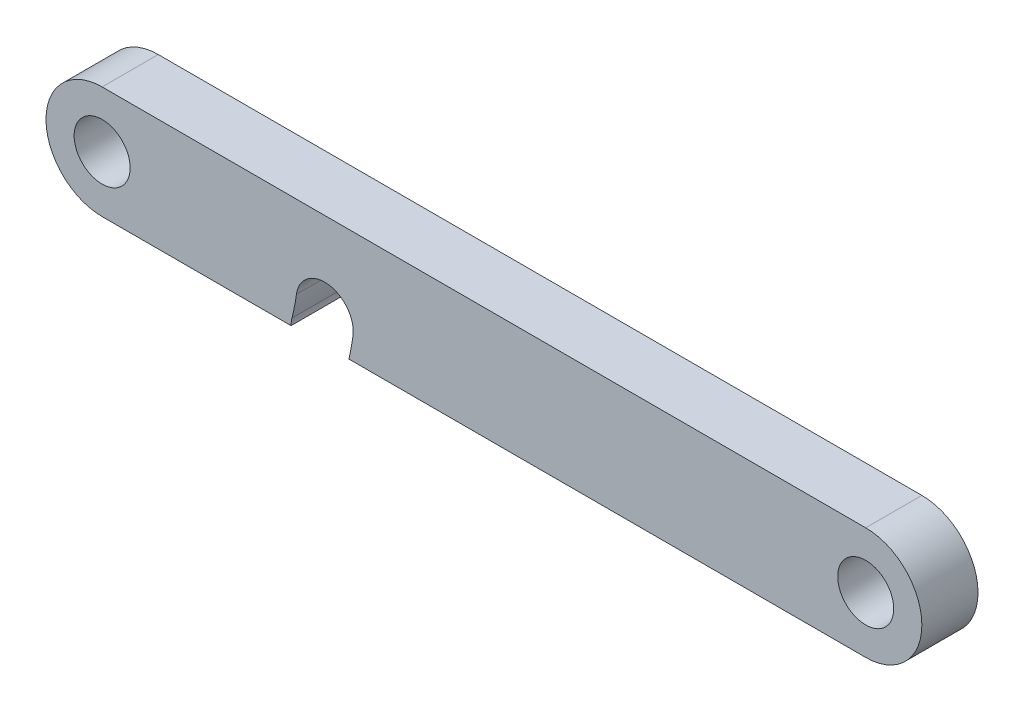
from build123d import *

# Parameters (mm, degrees)
SKETCH1_R               = 1.584200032
BOSS_EXTRUDE1_DEPTH     = 1.5875
CUT_EXTRUDE1_DEPTH      = 26.018113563
CUT_EXTRUDE1_DEPTH_BACK = 26.018113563


with BuildPart() as part:
    # Sketch1 → Boss-Extrude1 (new, symmetric)
    with BuildSketch(Plane.XY):
        with BuildLine():
            Line((-21.59, 3.175), (21.59, 3.175))
            ThreePointArc((21.59, 3.175), (24.765, 0), (21.59, -3.175))
            Line((21.59, -3.175), (-21.59, -3.175))
            ThreePointArc((-21.59, -3.175), (-24.765, 0), (-21.59, 3.175))
        make_face()
        with Locations((21.59, 0)):
            Circle(SKETCH1_R, mode=Mode.SUBTRACT)
        with Locations((-21.59, 0)):
            Circle(SKETCH1_R, mode=Mode.SUBTRACT)
    extrude(amount=BOSS_EXTRUDE1_DEPTH, both=True)

    # Sketch3 → Cut-Extrude1 (cut, two sides: drawn at the far end of the back side and taken through both)
    with BuildSketch(Plane.XY.offset(-CUT_EXTRUDE1_DEPTH_BACK)):
        with BuildLine():
            ThreePointArc((-7.731594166, -3.578225), (-7.544479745, -2.753628), (-7.406385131, -1.919420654))
            ThreePointArc((-7.406385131, -1.919420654), (-8.788419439, -0.104792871), (-10.603047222, -1.486827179))
            ThreePointArc((-10.603047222, -1.486827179), (-10.710018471, -2.133023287), (-10.854961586, -2.771775))
            ThreePointArc((-10.854961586, -2.771775), (-9.696502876, -4.73668371), (-7.731594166, -3.578225))
        make_face()
    extrude(amount=CUT_EXTRUDE1_DEPTH + CUT_EXTRUDE1_DEPTH_BACK, mode=Mode.SUBTRACT)


solid = part.part
